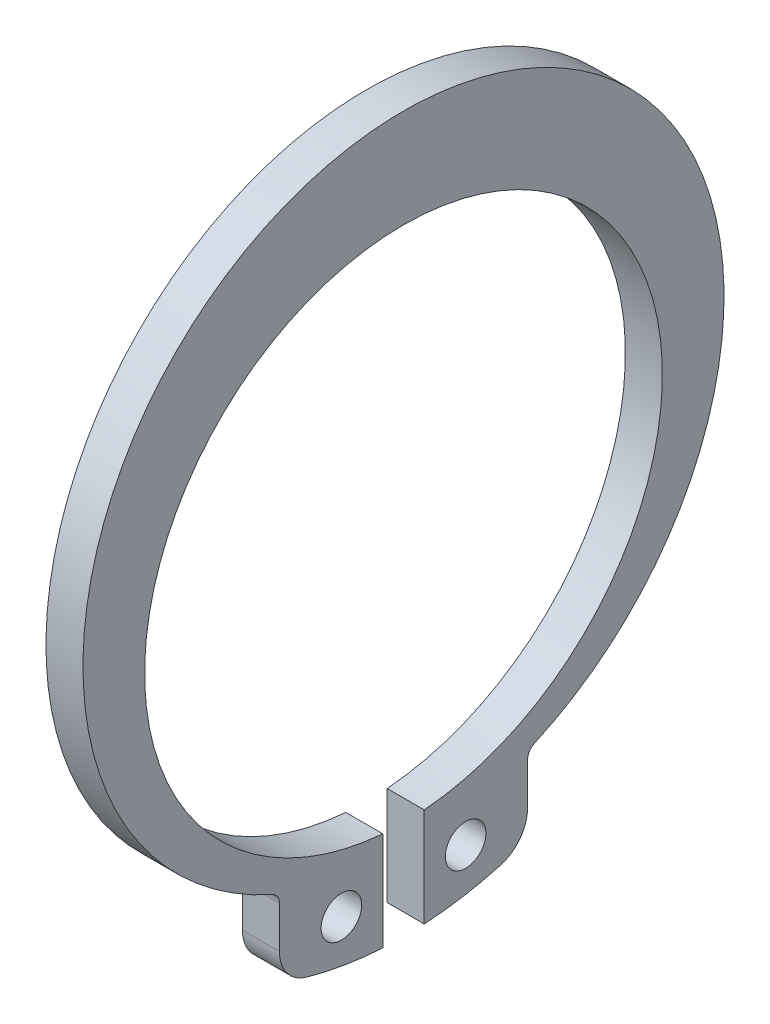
from build123d import *

# Parameters (mm, degrees)
ESQUISSE1_R          = 0.823144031
BASE_EXTRUSION_DEPTH = 1.5


with BuildPart() as part:
    # Esquisse1 → Base-Extrusion (new body)
    with BuildSketch(Plane(origin=(0, 0, 0), x_dir=(0, 0, -1), z_dir=(1, 0, 0))):
        with BuildLine():
            Line((0.84, -10.466346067), (0.84, -14.475648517))
            ThreePointArc((0.84, -14.475648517), (2.402405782, -14.299596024), (3.936564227, -13.955409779))
            ThreePointArc((3.936564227, -13.955409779), (4.725336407, -13.417051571), (5.029333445, -12.511746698))
            Line((5.029333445, -12.511746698), (5.029333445, -10.81570021))
            ThreePointArc((5.029333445, -10.81570021), (5.109574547, -10.544034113), (5.324543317, -10.359563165))
            ThreePointArc((5.324543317, -10.359563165), (0, 14.5), (-5.324543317, -10.359563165))
            ThreePointArc((-5.324543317, -10.359563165), (-5.109574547, -10.544034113), (-5.029333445, -10.81570021))
            Line((-5.029333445, -10.81570021), (-5.029333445, -12.511746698))
            ThreePointArc((-5.029333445, -12.511746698), (-4.725336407, -13.417051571), (-3.936564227, -13.955409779))
            ThreePointArc((-3.936564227, -13.955409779), (-2.402405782, -14.299596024), (-0.84, -14.475648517))
            Line((-0.84, -14.475648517), (-0.84, -10.466346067))
            ThreePointArc((-0.84, -10.466346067), (0, 10.5), (0.84, -10.466346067))
        make_face()
        with Locations((2.518742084, -12.537923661)):
            Circle(ESQUISSE1_R, mode=Mode.SUBTRACT)
        with Locations(Location((-2.518742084, -12.537923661, 0), (0, 0, 180))):
            Circle(ESQUISSE1_R, mode=Mode.SUBTRACT)
    extrude(amount=BASE_EXTRUSION_DEPTH)


solid = part.part
